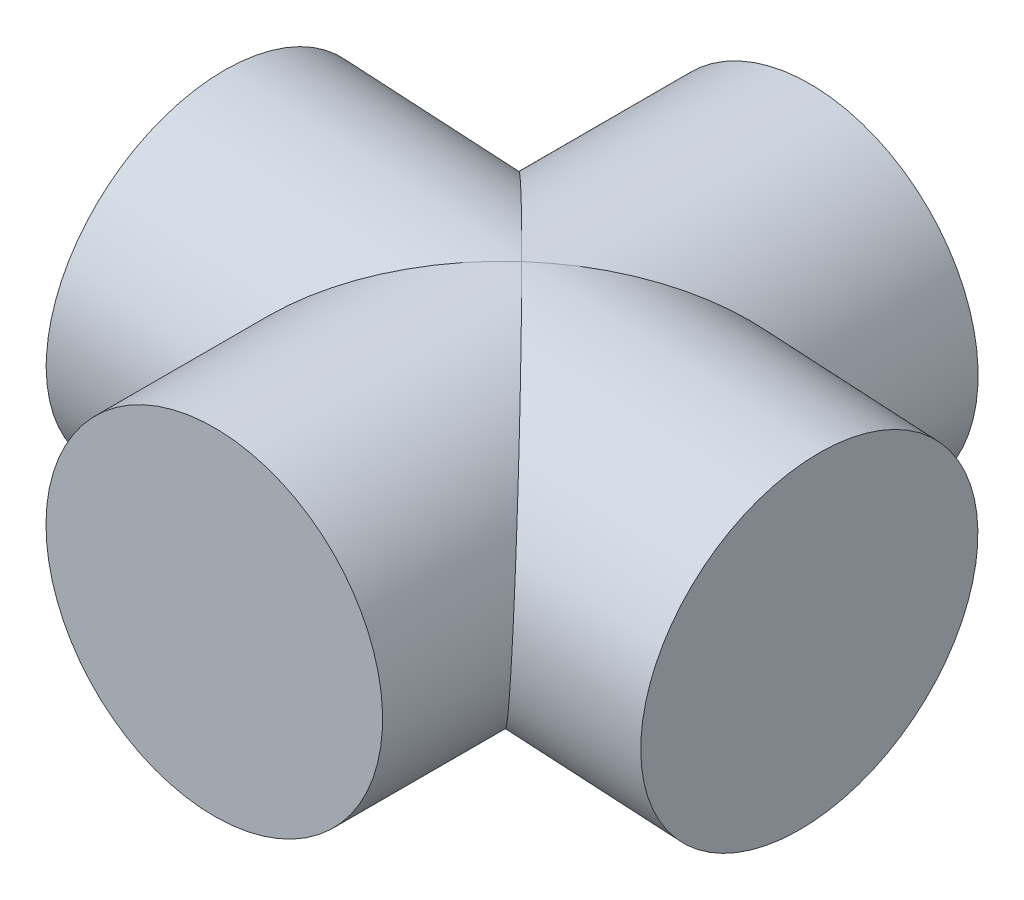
ISO-10303-21;
HEADER;
FILE_DESCRIPTION(('STEP AP214'),'2;1');
FILE_NAME('part.step','',(''),(''),'','','');
FILE_SCHEMA(('AUTOMOTIVE_DESIGN { 1 0 10303 214 1 1 1 1 }'));
ENDSEC;
DATA;
#1=APPLICATION_CONTEXT('core data for automotive mechanical design processes');
#2=APPLICATION_PROTOCOL_DEFINITION('international standard','automotive_design',2000,#1);
#3=PRODUCT_CONTEXT('',#1,'mechanical');
#4=PRODUCT('Part','Part','',(#3));
#5=PRODUCT_RELATED_PRODUCT_CATEGORY('part','',(#4));
#6=PRODUCT_DEFINITION_FORMATION('','',#4);
#7=PRODUCT_DEFINITION_CONTEXT('part definition',#1,'design');
#8=PRODUCT_DEFINITION('design','',#6,#7);
#9=PRODUCT_DEFINITION_SHAPE('','',#8);
#10=(LENGTH_UNIT() NAMED_UNIT(*) SI_UNIT(.MILLI.,.METRE.));
#11=(NAMED_UNIT(*) PLANE_ANGLE_UNIT() SI_UNIT($,.RADIAN.));
#12=(NAMED_UNIT(*) SI_UNIT($,.STERADIAN.) SOLID_ANGLE_UNIT());
#13=UNCERTAINTY_MEASURE_WITH_UNIT(LENGTH_MEASURE(1.E-05),#10,'distance_accuracy_value','');
#14=(GEOMETRIC_REPRESENTATION_CONTEXT(3) GLOBAL_UNCERTAINTY_ASSIGNED_CONTEXT((#13)) GLOBAL_UNIT_ASSIGNED_CONTEXT((#10,
#11,#12)) REPRESENTATION_CONTEXT('',''));
#15=CARTESIAN_POINT('',(0.,0.,0.));
#16=DIRECTION('',(0.,0.,1.));
#17=DIRECTION('',(1.,0.,0.));
#18=AXIS2_PLACEMENT_3D('',#15,#16,#17);
#19=CARTESIAN_POINT('',(8.98305462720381,-826.358422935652,27.4999321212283));
#20=DIRECTION('',(-0.998346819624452,0.0574771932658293,1.55845841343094E-07));
#21=DIRECTION('',(1.56103909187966E-07,0.,0.999999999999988));
#22=AXIS2_PLACEMENT_3D('',#19,#20,#21);
#23=CYLINDRICAL_SURFACE('',#22,6.5);
#24=DIRECTION('',(-0.998346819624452,0.0574771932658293,1.55845841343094E-07));
#25=VECTOR('',#24,1.);
#26=CARTESIAN_POINT('',(8.9830556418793,-826.358422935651,33.9999321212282));
#27=LINE('',#26,#25);
#28=CARTESIAN_POINT('',(8.98305564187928,-826.358422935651,33.9999321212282));
#29=VERTEX_POINT('',#28);
#30=CARTESIAN_POINT('',(6.48718859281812,-826.214729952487,33.9999325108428));
#31=VERTEX_POINT('',#30);
#32=EDGE_CURVE('E93',#29,#31,#27,.T.);
#33=ORIENTED_EDGE('',*,*,#32,.F.);
#34=ORIENTED_EDGE('',*,*,#32,.T.);
#35=CARTESIAN_POINT('',(-0.375668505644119,-832.330382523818,27.4999335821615));
#36=CARTESIAN_POINT('',(3.42564926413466,-832.549233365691,31.3075448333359));
#37=CARTESIAN_POINT('',(6.26833775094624,-830.016047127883,33.9999325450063));
#38=CARTESIAN_POINT('',(6.48718859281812,-826.214729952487,33.9999325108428));
#39=(BOUNDED_CURVE() B_SPLINE_CURVE(3,(#35,#36,#37,#38),.UNSPECIFIED.,.F.,
.F.) B_SPLINE_CURVE_WITH_KNOTS((4,4),(1.5707963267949,3.1415926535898),
.UNSPECIFIED.) CURVE() GEOMETRIC_REPRESENTATION_ITEM() RATIONAL_B_SPLINE_CURVE((1.,
0.804737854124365,0.804737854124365,1.)) REPRESENTATION_ITEM(''));
#40=CARTESIAN_POINT('',(-0.375668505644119,-832.330382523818,27.4999335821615));
#41=VERTEX_POINT('',#40);
#42=EDGE_CURVE('E85',#41,#31,#39,.T.);
#43=ORIENTED_EDGE('',*,*,#42,.F.);
#44=CARTESIAN_POINT('',(6.48718656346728,-826.214729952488,20.9999325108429));
#45=CARTESIAN_POINT('',(6.2683357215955,-830.016047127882,20.9999325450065));
#46=CARTESIAN_POINT('',(3.42564807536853,-832.54923336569,23.6923211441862));
#47=CARTESIAN_POINT('',(-0.375668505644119,-832.330382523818,27.4999335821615));
#48=(BOUNDED_CURVE() B_SPLINE_CURVE(3,(#44,#45,#46,#47),.UNSPECIFIED.,.F.,
.F.) B_SPLINE_CURVE_WITH_KNOTS((4,4),(3.1415926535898,4.71238898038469),
.UNSPECIFIED.) CURVE() GEOMETRIC_REPRESENTATION_ITEM() RATIONAL_B_SPLINE_CURVE((1.,
0.804737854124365,0.804737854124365,1.)) REPRESENTATION_ITEM(''));
#49=CARTESIAN_POINT('',(6.48718656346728,-826.214729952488,20.9999325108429));
#50=VERTEX_POINT('',#49);
#51=EDGE_CURVE('E64',#50,#41,#48,.T.);
#52=ORIENTED_EDGE('',*,*,#51,.F.);
#53=DIRECTION('',(-0.998346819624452,0.0574771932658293,1.55845841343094E-07));
#54=VECTOR('',#53,1.);
#55=CARTESIAN_POINT('',(8.9830536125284,-826.358422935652,20.9999321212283));
#56=LINE('',#55,#54);
#57=CARTESIAN_POINT('',(8.9830536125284,-826.358422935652,20.9999321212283));
#58=VERTEX_POINT('',#57);
#59=EDGE_CURVE('E99',#58,#50,#56,.T.);
#60=ORIENTED_EDGE('',*,*,#59,.F.);
#61=ORIENTED_EDGE('',*,*,#59,.T.);
#62=CARTESIAN_POINT('',(0.371535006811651,-819.3518738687,27.4999334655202));
#63=CARTESIAN_POINT('',(4.17285158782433,-819.570724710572,23.6923210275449));
#64=CARTESIAN_POINT('',(6.70603740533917,-822.413412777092,20.9999324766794));
#65=CARTESIAN_POINT('',(6.48718656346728,-826.214729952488,20.9999325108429));
#66=(BOUNDED_CURVE() B_SPLINE_CURVE(3,(#62,#63,#64,#65),.UNSPECIFIED.,.F.,
.F.) B_SPLINE_CURVE_WITH_KNOTS((4,4),(1.5707963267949,3.1415926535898),
.UNSPECIFIED.) CURVE() GEOMETRIC_REPRESENTATION_ITEM() RATIONAL_B_SPLINE_CURVE((1.,
0.804737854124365,0.804737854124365,1.)) REPRESENTATION_ITEM(''));
#67=CARTESIAN_POINT('',(0.371535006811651,-819.3518738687,27.4999334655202));
#68=VERTEX_POINT('',#67);
#69=EDGE_CURVE('E80',#68,#50,#66,.T.);
#70=ORIENTED_EDGE('',*,*,#69,.F.);
#71=CARTESIAN_POINT('',(6.48718859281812,-826.214729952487,33.9999325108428));
#72=CARTESIAN_POINT('',(6.70603943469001,-822.413412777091,33.9999324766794));
#73=CARTESIAN_POINT('',(4.17285277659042,-819.570724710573,31.3075447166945));
#74=CARTESIAN_POINT('',(0.371535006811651,-819.3518738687,27.4999334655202));
#75=(BOUNDED_CURVE() B_SPLINE_CURVE(3,(#71,#72,#73,#74),.UNSPECIFIED.,.F.,
.F.) B_SPLINE_CURVE_WITH_KNOTS((4,4),(3.1415926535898,4.71238898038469),
.UNSPECIFIED.) CURVE() GEOMETRIC_REPRESENTATION_ITEM() RATIONAL_B_SPLINE_CURVE((1.,
0.804737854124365,0.804737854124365,1.)) REPRESENTATION_ITEM(''));
#76=EDGE_CURVE('E102',#31,#68,#75,.T.);
#77=ORIENTED_EDGE('',*,*,#76,.F.);
#78=EDGE_LOOP('',(#33,#34,#43,#52,#60,#61,#70,#77));
#79=FACE_BOUND('',#78,.T.);
#80=CARTESIAN_POINT('',(11.478921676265,-826.502115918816,27.4999317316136));
#81=DIRECTION('',(-0.998346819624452,0.0574771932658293,1.55845841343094E-07));
#82=DIRECTION('',(-0.00396844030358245,-0.0689323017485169,0.997613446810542));
#83=AXIS2_PLACEMENT_3D('',#80,#81,#82);
#84=CIRCLE('',#83,6.5);
#85=CARTESIAN_POINT('',(11.4531268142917,-826.950175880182,33.9844191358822));
#86=VERTEX_POINT('',#85);
#87=EDGE_CURVE('E108',#86,#86,#84,.T.);
#88=ORIENTED_EDGE('',*,*,#87,.T.);
#89=EDGE_LOOP('',(#88));
#90=FACE_BOUND('',#89,.T.);
#91=ADVANCED_FACE('F14',(#79,#90),#23,.T.);
#92=CARTESIAN_POINT('',(-0.00206534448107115,-825.841128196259,36.4999335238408));
#93=DIRECTION('',(-1.56103906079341E-07,0.,-0.999999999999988));
#94=DIRECTION('',(-0.998346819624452,0.0574771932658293,1.55845837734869E-07));
#95=AXIS2_PLACEMENT_3D('',#92,#93,#94);
#96=CYLINDRICAL_SURFACE('',#95,6.5);
#97=ORIENTED_EDGE('',*,*,#69,.T.);
#98=DIRECTION('',(-1.56103906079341E-07,0.,-0.999999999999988));
#99=VECTOR('',#98,1.);
#100=CARTESIAN_POINT('',(6.48718898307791,-826.214729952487,36.4999325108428));
#101=LINE('',#100,#99);
#102=CARTESIAN_POINT('',(6.48718617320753,-826.214729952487,18.499932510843));
#103=VERTEX_POINT('',#102);
#104=EDGE_CURVE('E18',#50,#103,#101,.T.);
#105=ORIENTED_EDGE('',*,*,#104,.T.);
#106=ORIENTED_EDGE('',*,*,#104,.F.);
#107=ORIENTED_EDGE('',*,*,#51,.T.);
#108=CARTESIAN_POINT('',(-0.375668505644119,-832.330382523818,27.4999335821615));
#109=CARTESIAN_POINT('',(-4.17698627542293,-832.111531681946,23.6923223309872));
#110=CARTESIAN_POINT('',(-6.71017293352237,-829.268843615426,20.9999345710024));
#111=CARTESIAN_POINT('',(-6.49132209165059,-825.467526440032,20.9999345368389));
#112=(BOUNDED_CURVE() B_SPLINE_CURVE(3,(#108,#109,#110,#111),.UNSPECIFIED.,.F.,
.F.) B_SPLINE_CURVE_WITH_KNOTS((4,4),(4.71238898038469,6.28318530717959),
.UNSPECIFIED.) CURVE() GEOMETRIC_REPRESENTATION_ITEM() RATIONAL_B_SPLINE_CURVE((1.,
0.804737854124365,0.804737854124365,1.)) REPRESENTATION_ITEM(''));
#113=CARTESIAN_POINT('',(-6.49132209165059,-825.467526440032,20.9999345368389));
#114=VERTEX_POINT('',#113);
#115=EDGE_CURVE('E25',#41,#114,#112,.T.);
#116=ORIENTED_EDGE('',*,*,#115,.T.);
#117=DIRECTION('',(-1.56103906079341E-07,0.,-0.999999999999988));
#118=VECTOR('',#117,1.);
#119=CARTESIAN_POINT('',(-6.49131967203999,-825.467526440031,36.4999345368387));
#120=LINE('',#119,#118);
#121=CARTESIAN_POINT('',(-6.49132248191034,-825.467526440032,18.4999345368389));
#122=VERTEX_POINT('',#121);
#123=EDGE_CURVE('E149',#114,#122,#120,.T.);
#124=ORIENTED_EDGE('',*,*,#123,.T.);
#125=ORIENTED_EDGE('',*,*,#123,.F.);
#126=CARTESIAN_POINT('',(-6.49132209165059,-825.467526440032,20.9999345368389));
#127=CARTESIAN_POINT('',(-6.27247124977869,-821.666209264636,20.9999345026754));
#128=CARTESIAN_POINT('',(-3.42978276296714,-819.133023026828,23.6923222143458));
#129=CARTESIAN_POINT('',(0.371535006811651,-819.3518738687,27.4999334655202));
#130=(BOUNDED_CURVE() B_SPLINE_CURVE(3,(#126,#127,#128,#129),.UNSPECIFIED.,.F.,
.F.) B_SPLINE_CURVE_WITH_KNOTS((4,4),(0.,1.5707963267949),
.UNSPECIFIED.) CURVE() GEOMETRIC_REPRESENTATION_ITEM() RATIONAL_B_SPLINE_CURVE((1.,
0.804737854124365,0.804737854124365,1.)) REPRESENTATION_ITEM(''));
#131=EDGE_CURVE('E147',#114,#68,#130,.T.);
#132=ORIENTED_EDGE('',*,*,#131,.T.);
#133=EDGE_LOOP('',(#97,#105,#106,#107,#116,#124,#125,#132));
#134=FACE_BOUND('',#133,.T.);
#135=CARTESIAN_POINT('',(-0.00206854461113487,-825.841128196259,15.999933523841));
#136=DIRECTION('',(1.56103906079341E-07,0.,0.999999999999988));
#137=DIRECTION('',(0.998346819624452,-0.0574771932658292,-1.55845837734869E-07));
#138=AXIS2_PLACEMENT_3D('',#135,#136,#137);
#139=CIRCLE('',#138,6.5);
#140=CARTESIAN_POINT('',(6.4871857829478,-826.214729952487,15.999932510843));
#141=VERTEX_POINT('',#140);
#142=EDGE_CURVE('E190',#141,#141,#139,.T.);
#143=ORIENTED_EDGE('',*,*,#142,.T.);
#144=EDGE_LOOP('',(#143));
#145=FACE_BOUND('',#144,.T.);
#146=ADVANCED_FACE('F16',(#134,#145),#96,.T.);
#147=CARTESIAN_POINT('',(8.98305462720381,-826.358422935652,27.4999321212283));
#148=DIRECTION('',(-0.998346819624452,0.0574771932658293,1.55845841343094E-07));
#149=DIRECTION('',(1.56103909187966E-07,0.,0.999999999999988));
#150=AXIS2_PLACEMENT_3D('',#147,#148,#149);
#151=CYLINDRICAL_SURFACE('',#150,6.5);
#152=ORIENTED_EDGE('',*,*,#131,.F.);
#153=DIRECTION('',(-0.998346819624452,0.0574771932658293,1.55845841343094E-07));
#154=VECTOR('',#153,1.);
#155=CARTESIAN_POINT('',(8.9830536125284,-826.358422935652,20.9999321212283));
#156=LINE('',#155,#154);
#157=CARTESIAN_POINT('',(-8.98718914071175,-825.323833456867,20.9999349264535));
#158=VERTEX_POINT('',#157);
#159=EDGE_CURVE('E174',#114,#158,#156,.T.);
#160=ORIENTED_EDGE('',*,*,#159,.T.);
#161=ORIENTED_EDGE('',*,*,#159,.F.);
#162=ORIENTED_EDGE('',*,*,#115,.F.);
#163=CARTESIAN_POINT('',(-6.49132006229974,-825.467526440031,33.9999345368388));
#164=CARTESIAN_POINT('',(-6.71017090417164,-829.268843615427,33.9999345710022));
#165=CARTESIAN_POINT('',(-4.17698508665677,-832.111531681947,31.3075460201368));
#166=CARTESIAN_POINT('',(-0.375668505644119,-832.330382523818,27.4999335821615));
#167=(BOUNDED_CURVE() B_SPLINE_CURVE(3,(#163,#164,#165,#166),.UNSPECIFIED.,.F.,
.F.) B_SPLINE_CURVE_WITH_KNOTS((4,4),(0.,1.5707963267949),
.UNSPECIFIED.) CURVE() GEOMETRIC_REPRESENTATION_ITEM() RATIONAL_B_SPLINE_CURVE((1.,
0.804737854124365,0.804737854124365,1.)) REPRESENTATION_ITEM(''));
#168=CARTESIAN_POINT('',(-6.49132006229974,-825.467526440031,33.9999345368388));
#169=VERTEX_POINT('',#168);
#170=EDGE_CURVE('E9',#169,#41,#167,.T.);
#171=ORIENTED_EDGE('',*,*,#170,.F.);
#172=DIRECTION('',(-0.998346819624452,0.0574771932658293,1.55845841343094E-07));
#173=VECTOR('',#172,1.);
#174=CARTESIAN_POINT('',(8.9830556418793,-826.358422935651,33.9999321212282));
#175=LINE('',#174,#173);
#176=CARTESIAN_POINT('',(-8.98718711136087,-825.323833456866,33.9999349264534));
#177=VERTEX_POINT('',#176);
#178=EDGE_CURVE('E54',#169,#177,#175,.T.);
#179=ORIENTED_EDGE('',*,*,#178,.T.);
#180=ORIENTED_EDGE('',*,*,#178,.F.);
#181=CARTESIAN_POINT('',(0.371535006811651,-819.3518738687,27.4999334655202));
#182=CARTESIAN_POINT('',(-3.42978157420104,-819.133023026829,31.3075459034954));
#183=CARTESIAN_POINT('',(-6.27246922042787,-821.666209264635,33.9999345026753));
#184=CARTESIAN_POINT('',(-6.49132006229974,-825.467526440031,33.9999345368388));
#185=(BOUNDED_CURVE() B_SPLINE_CURVE(3,(#181,#182,#183,#184),.UNSPECIFIED.,.F.,
.F.) B_SPLINE_CURVE_WITH_KNOTS((4,4),(4.71238898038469,6.28318530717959),
.UNSPECIFIED.) CURVE() GEOMETRIC_REPRESENTATION_ITEM() RATIONAL_B_SPLINE_CURVE((1.,
0.804737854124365,0.804737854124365,1.)) REPRESENTATION_ITEM(''));
#186=EDGE_CURVE('E105',#68,#169,#185,.T.);
#187=ORIENTED_EDGE('',*,*,#186,.F.);
#188=EDGE_LOOP('',(#152,#160,#161,#162,#171,#179,#180,#187));
#189=FACE_BOUND('',#188,.T.);
#190=CARTESIAN_POINT('',(-11.4830551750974,-825.180140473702,27.499935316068));
#191=DIRECTION('',(-0.998346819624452,0.0574771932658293,1.55845841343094E-07));
#192=DIRECTION('',(-0.00396844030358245,-0.0689323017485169,0.997613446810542));
#193=AXIS2_PLACEMENT_3D('',#190,#191,#192);
#194=CIRCLE('',#193,6.5);
#195=CARTESIAN_POINT('',(-11.5088500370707,-825.628200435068,33.9844227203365));
#196=VERTEX_POINT('',#195);
#197=EDGE_CURVE('E115',#196,#196,#194,.T.);
#198=ORIENTED_EDGE('',*,*,#197,.F.);
#199=EDGE_LOOP('',(#198));
#200=FACE_BOUND('',#199,.T.);
#201=ADVANCED_FACE('F201',(#189,#200),#151,.T.);
#202=CARTESIAN_POINT('',(-0.00206534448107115,-825.841128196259,36.4999335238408));
#203=DIRECTION('',(-1.56103906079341E-07,0.,-0.999999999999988));
#204=DIRECTION('',(-0.998346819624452,0.0574771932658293,1.55845837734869E-07));
#205=AXIS2_PLACEMENT_3D('',#202,#203,#204);
#206=CYLINDRICAL_SURFACE('',#205,6.5);
#207=DIRECTION('',(-1.56103906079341E-07,0.,-0.999999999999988));
#208=VECTOR('',#207,1.);
#209=CARTESIAN_POINT('',(-6.49131967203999,-825.467526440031,36.4999345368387));
#210=LINE('',#209,#208);
#211=CARTESIAN_POINT('',(-6.49131967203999,-825.467526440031,36.4999345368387));
#212=VERTEX_POINT('',#211);
#213=EDGE_CURVE('E142',#212,#169,#210,.T.);
#214=ORIENTED_EDGE('',*,*,#213,.F.);
#215=ORIENTED_EDGE('',*,*,#213,.T.);
#216=ORIENTED_EDGE('',*,*,#170,.T.);
#217=ORIENTED_EDGE('',*,*,#42,.T.);
#218=DIRECTION('',(-1.56103906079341E-07,0.,-0.999999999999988));
#219=VECTOR('',#218,1.);
#220=CARTESIAN_POINT('',(6.48718898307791,-826.214729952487,36.4999325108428));
#221=LINE('',#220,#219);
#222=CARTESIAN_POINT('',(6.48718898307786,-826.214729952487,36.4999325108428));
#223=VERTEX_POINT('',#222);
#224=EDGE_CURVE('E91',#223,#31,#221,.T.);
#225=ORIENTED_EDGE('',*,*,#224,.F.);
#226=ORIENTED_EDGE('',*,*,#224,.T.);
#227=ORIENTED_EDGE('',*,*,#76,.T.);
#228=ORIENTED_EDGE('',*,*,#186,.T.);
#229=EDGE_LOOP('',(#214,#215,#216,#217,#225,#226,#227,#228));
#230=FACE_BOUND('',#229,.T.);
#231=CARTESIAN_POINT('',(-0.00206495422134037,-825.841128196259,38.9999335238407));
#232=DIRECTION('',(1.56103906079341E-07,0.,0.999999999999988));
#233=DIRECTION('',(0.998346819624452,-0.0574771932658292,-1.55845837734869E-07));
#234=AXIS2_PLACEMENT_3D('',#231,#232,#233);
#235=CIRCLE('',#234,6.5);
#236=CARTESIAN_POINT('',(6.4871893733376,-826.214729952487,38.9999325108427));
#237=VERTEX_POINT('',#236);
#238=EDGE_CURVE('E194',#237,#237,#235,.T.);
#239=ORIENTED_EDGE('',*,*,#238,.F.);
#240=EDGE_LOOP('',(#239));
#241=FACE_BOUND('',#240,.T.);
#242=ADVANCED_FACE('F87',(#230,#241),#206,.T.);
#243=CARTESIAN_POINT('',(11.478921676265,-826.502115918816,27.4999317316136));
#244=DIRECTION('',(-0.998346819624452,0.0574771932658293,1.55845841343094E-07));
#245=DIRECTION('',(-0.00396844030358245,-0.0689323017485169,0.997613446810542));
#246=AXIS2_PLACEMENT_3D('',#243,#244,#245);
#247=PLANE('',#246);
#248=ORIENTED_EDGE('',*,*,#87,.F.);
#249=EDGE_LOOP('',(#248));
#250=FACE_BOUND('',#249,.T.);
#251=ADVANCED_FACE('F200',(#250),#247,.F.);
#252=CARTESIAN_POINT('',(-11.4830551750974,-825.180140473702,27.499935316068));
#253=DIRECTION('',(-0.998346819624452,0.0574771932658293,1.55845841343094E-07));
#254=DIRECTION('',(-0.00396844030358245,-0.0689323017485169,0.997613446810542));
#255=AXIS2_PLACEMENT_3D('',#252,#253,#254);
#256=PLANE('',#255);
#257=ORIENTED_EDGE('',*,*,#197,.T.);
#258=EDGE_LOOP('',(#257));
#259=FACE_BOUND('',#258,.T.);
#260=ADVANCED_FACE('F207',(#259),#256,.T.);
#261=CARTESIAN_POINT('',(-0.00206854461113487,-825.841128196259,15.999933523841));
#262=DIRECTION('',(1.56103906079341E-07,0.,0.999999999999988));
#263=DIRECTION('',(0.998346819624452,-0.0574771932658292,-1.55845837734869E-07));
#264=AXIS2_PLACEMENT_3D('',#261,#262,#263);
#265=PLANE('',#264);
#266=ORIENTED_EDGE('',*,*,#142,.F.);
#267=EDGE_LOOP('',(#266));
#268=FACE_BOUND('',#267,.T.);
#269=ADVANCED_FACE('F219',(#268),#265,.F.);
#270=CARTESIAN_POINT('',(-0.00206495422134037,-825.841128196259,38.9999335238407));
#271=DIRECTION('',(1.56103906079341E-07,0.,0.999999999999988));
#272=DIRECTION('',(0.998346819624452,-0.0574771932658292,-1.55845837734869E-07));
#273=AXIS2_PLACEMENT_3D('',#270,#271,#272);
#274=PLANE('',#273);
#275=ORIENTED_EDGE('',*,*,#238,.T.);
#276=EDGE_LOOP('',(#275));
#277=FACE_BOUND('',#276,.T.);
#278=ADVANCED_FACE('F198',(#277),#274,.T.);
#279=CLOSED_SHELL('',(#91,#146,#201,#242,#251,#260,#269,#278));
#280=MANIFOLD_SOLID_BREP('B1',#279);
#281=ADVANCED_BREP_SHAPE_REPRESENTATION('',(#18,#280),#14);
#282=SHAPE_DEFINITION_REPRESENTATION(#9,#281);
ENDSEC;
END-ISO-10303-21;
